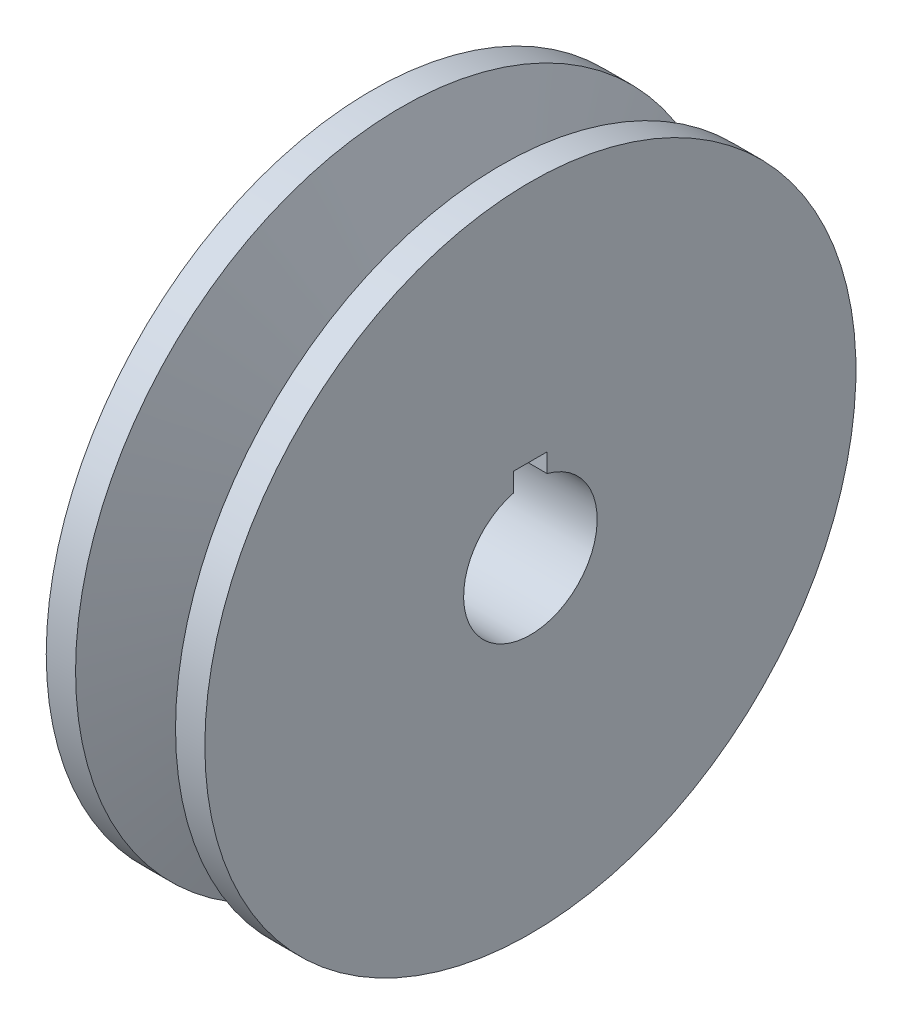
from build123d import *

# Parameters (mm, degrees)
ENL_V_MAT_EXTRU_1_DEPTH = 59.335238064


with BuildPart() as part:
    # Esquisse1 → R_volution1 (revolve)
    with BuildSketch(Plane.XY, mode=Mode.PRIVATE) as r_volution1_sk:
        Polygon((0, 0), (19, 0), (19, 39), (15.487379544, 39), (11.425883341, 26.5), (7.574116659, 26.5), (3.512620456, 39), (0, 39), align=None)
    revolve(r_volution1_sk.sketch.rotate(Axis((19, 0, 0), (1, 0, 0)), 90), axis=Axis((19, 0, 0), (1, 0, 0)))

    # Esquisse2 → Enl_v. mat.-Extru.1 (cut, through all)
    with BuildSketch(Plane(origin=(19, 0, 0), x_dir=(0, 0, -1), z_dir=(1, 0, 0))):
        with BuildLine():
            Line((-2, 10), (2, 10))
            Line((2, 10), (2, 7.745966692))
            ThreePointArc((2, 7.745966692), (0, -8), (-2, 7.745966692))
            Line((-2, 7.745966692), (-2, 10))
        make_face()
    extrude(amount=-ENL_V_MAT_EXTRU_1_DEPTH, mode=Mode.SUBTRACT)


solid = part.part
